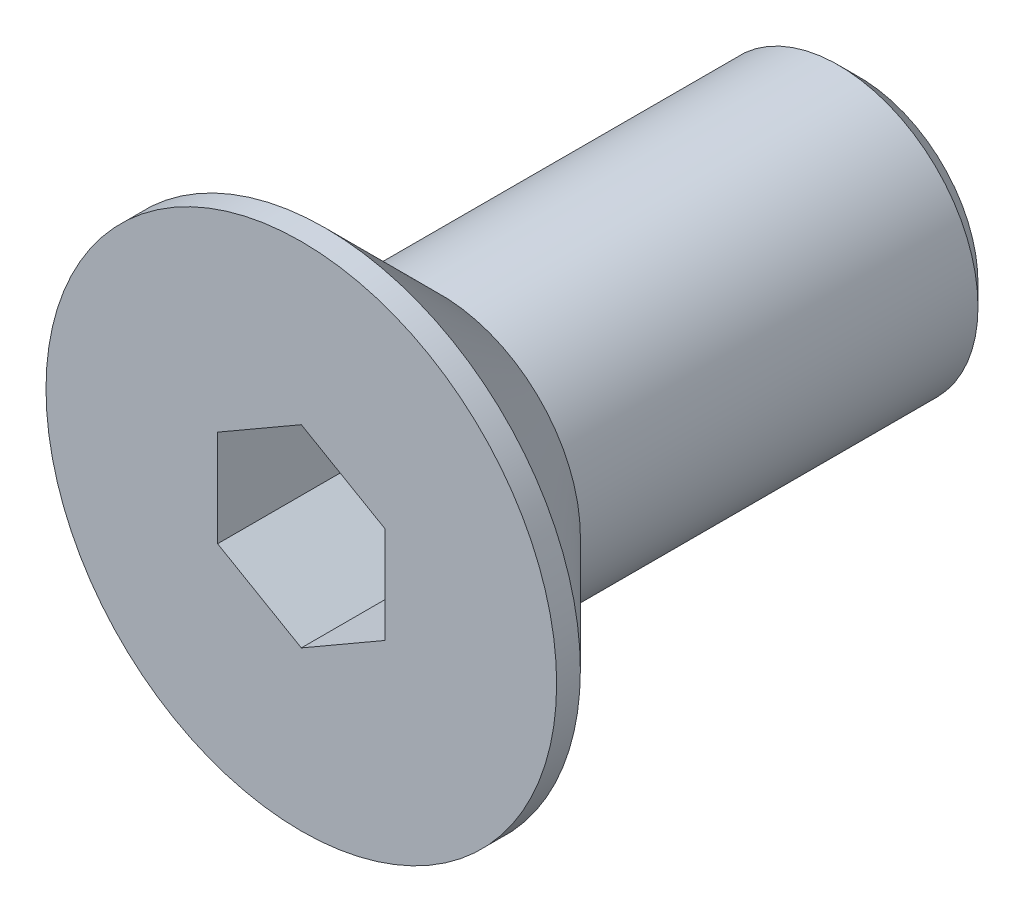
ISO-10303-21;
HEADER;
FILE_DESCRIPTION(('STEP AP214'),'2;1');
FILE_NAME('part.step','',(''),(''),'','','');
FILE_SCHEMA(('AUTOMOTIVE_DESIGN { 1 0 10303 214 1 1 1 1 }'));
ENDSEC;
DATA;
#1=APPLICATION_CONTEXT('core data for automotive mechanical design processes');
#2=APPLICATION_PROTOCOL_DEFINITION('international standard','automotive_design',2000,#1);
#3=PRODUCT_CONTEXT('',#1,'mechanical');
#4=PRODUCT('Part','Part','',(#3));
#5=PRODUCT_RELATED_PRODUCT_CATEGORY('part','',(#4));
#6=PRODUCT_DEFINITION_FORMATION('','',#4);
#7=PRODUCT_DEFINITION_CONTEXT('part definition',#1,'design');
#8=PRODUCT_DEFINITION('design','',#6,#7);
#9=PRODUCT_DEFINITION_SHAPE('','',#8);
#10=(LENGTH_UNIT() NAMED_UNIT(*) SI_UNIT(.MILLI.,.METRE.));
#11=(NAMED_UNIT(*) PLANE_ANGLE_UNIT() SI_UNIT($,.RADIAN.));
#12=(NAMED_UNIT(*) SI_UNIT($,.STERADIAN.) SOLID_ANGLE_UNIT());
#13=UNCERTAINTY_MEASURE_WITH_UNIT(LENGTH_MEASURE(1.E-05),#10,'distance_accuracy_value','');
#14=(GEOMETRIC_REPRESENTATION_CONTEXT(3) GLOBAL_UNCERTAINTY_ASSIGNED_CONTEXT((#13)) GLOBAL_UNIT_ASSIGNED_CONTEXT((#10,
#11,#12)) REPRESENTATION_CONTEXT('',''));
#15=CARTESIAN_POINT('',(0.,0.,0.));
#16=DIRECTION('',(0.,0.,1.));
#17=DIRECTION('',(1.,0.,0.));
#18=AXIS2_PLACEMENT_3D('',#15,#16,#17);
#19=CARTESIAN_POINT('',(0.,0.,-15.));
#20=DIRECTION('',(0.,0.,-1.));
#21=DIRECTION('',(-1.,0.,0.));
#22=AXIS2_PLACEMENT_3D('',#19,#20,#21);
#23=PLANE('',#22);
#24=CARTESIAN_POINT('',(0.,0.,-15.0000000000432));
#25=DIRECTION('',(0.,0.,1.));
#26=DIRECTION('',(0.,-1.,0.));
#27=AXIS2_PLACEMENT_3D('',#24,#25,#26);
#28=CIRCLE('',#27,4.24999999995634);
#29=CARTESIAN_POINT('',(0.,-4.24999999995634,-15.0000000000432));
#30=VERTEX_POINT('',#29);
#31=EDGE_CURVE('E20',#30,#30,#28,.T.);
#32=ORIENTED_EDGE('',*,*,#31,.F.);
#33=EDGE_LOOP('',(#32));
#34=FACE_BOUND('',#33,.T.);
#35=ADVANCED_FACE('F17',(#34),#23,.T.);
#36=CARTESIAN_POINT('',(0.,0.,-14.2500000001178));
#37=DIRECTION('',(0.,0.,1.));
#38=DIRECTION('',(0.,-1.,0.));
#39=AXIS2_PLACEMENT_3D('',#36,#37,#38);
#40=CONICAL_SURFACE('',#39,4.99999999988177,0.785398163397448);
#41=CARTESIAN_POINT('',(0.,0.,-14.25));
#42=DIRECTION('',(0.,0.,1.));
#43=DIRECTION('',(1.,0.,0.));
#44=AXIS2_PLACEMENT_3D('',#41,#42,#43);
#45=CIRCLE('',#44,5.);
#46=CARTESIAN_POINT('',(5.,0.,-14.25));
#47=VERTEX_POINT('',#46);
#48=EDGE_CURVE('E102',#47,#47,#45,.T.);
#49=ORIENTED_EDGE('',*,*,#48,.F.);
#50=EDGE_LOOP('',(#49));
#51=FACE_BOUND('',#50,.T.);
#52=ORIENTED_EDGE('',*,*,#31,.T.);
#53=EDGE_LOOP('',(#52));
#54=FACE_BOUND('',#53,.T.);
#55=ADVANCED_FACE('F109',(#51,#54),#40,.T.);
#56=CARTESIAN_POINT('',(0.,0.,0.));
#57=DIRECTION('',(0.,0.,1.));
#58=DIRECTION('',(1.,0.,0.));
#59=AXIS2_PLACEMENT_3D('',#56,#57,#58);
#60=CYLINDRICAL_SURFACE('',#59,5.);
#61=CARTESIAN_POINT('',(0.,0.,-2.61483543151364E-11));
#62=DIRECTION('',(0.,0.,1.));
#63=DIRECTION('',(1.,0.,0.));
#64=AXIS2_PLACEMENT_3D('',#61,#62,#63);
#65=CIRCLE('',#64,5.00000000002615);
#66=CARTESIAN_POINT('',(5.00000000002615,0.,-2.61483543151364E-11));
#67=VERTEX_POINT('',#66);
#68=EDGE_CURVE('E80',#67,#67,#65,.T.);
#69=ORIENTED_EDGE('',*,*,#68,.F.);
#70=EDGE_LOOP('',(#69));
#71=FACE_BOUND('',#70,.T.);
#72=ORIENTED_EDGE('',*,*,#48,.T.);
#73=EDGE_LOOP('',(#72));
#74=FACE_BOUND('',#73,.T.);
#75=ADVANCED_FACE('F116',(#71,#74),#60,.T.);
#76=CARTESIAN_POINT('',(3.,1.73205080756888,0.5));
#77=DIRECTION('',(0.,0.,1.));
#78=DIRECTION('',(1.,0.,0.));
#79=AXIS2_PLACEMENT_3D('',#76,#77,#78);
#80=PLANE('',#79);
#81=DIRECTION('',(0.866025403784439,0.5,0.));
#82=VECTOR('',#81,1.);
#83=CARTESIAN_POINT('',(0.,3.46410161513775,0.499999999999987));
#84=LINE('',#83,#82);
#85=CARTESIAN_POINT('',(-3.,1.73205080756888,0.499999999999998));
#86=VERTEX_POINT('',#85);
#87=CARTESIAN_POINT('',(0.,3.46410161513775,0.499999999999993));
#88=VERTEX_POINT('',#87);
#89=EDGE_CURVE('E66',#86,#88,#84,.T.);
#90=ORIENTED_EDGE('',*,*,#89,.F.);
#91=DIRECTION('',(0.,1.,0.));
#92=VECTOR('',#91,1.);
#93=CARTESIAN_POINT('',(-3.,1.73205080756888,0.5));
#94=LINE('',#93,#92);
#95=CARTESIAN_POINT('',(-3.,-1.73205080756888,0.499999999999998));
#96=VERTEX_POINT('',#95);
#97=EDGE_CURVE('E71',#96,#86,#94,.T.);
#98=ORIENTED_EDGE('',*,*,#97,.F.);
#99=DIRECTION('',(-0.866025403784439,0.5,0.));
#100=VECTOR('',#99,1.);
#101=CARTESIAN_POINT('',(-3.,-1.73205080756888,0.499999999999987));
#102=LINE('',#101,#100);
#103=CARTESIAN_POINT('',(0.,-3.46410161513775,0.499999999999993));
#104=VERTEX_POINT('',#103);
#105=EDGE_CURVE('E99',#104,#96,#102,.T.);
#106=ORIENTED_EDGE('',*,*,#105,.F.);
#107=DIRECTION('',(-0.866025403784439,-0.5,0.));
#108=VECTOR('',#107,1.);
#109=CARTESIAN_POINT('',(0.,-3.46410161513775,0.499999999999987));
#110=LINE('',#109,#108);
#111=CARTESIAN_POINT('',(3.,-1.73205080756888,0.499999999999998));
#112=VERTEX_POINT('',#111);
#113=EDGE_CURVE('E227',#112,#104,#110,.T.);
#114=ORIENTED_EDGE('',*,*,#113,.F.);
#115=DIRECTION('',(0.,-1.,0.));
#116=VECTOR('',#115,1.);
#117=CARTESIAN_POINT('',(3.,-1.73205080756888,0.5));
#118=LINE('',#117,#116);
#119=CARTESIAN_POINT('',(3.,1.73205080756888,0.499999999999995));
#120=VERTEX_POINT('',#119);
#121=EDGE_CURVE('E222',#120,#112,#118,.T.);
#122=ORIENTED_EDGE('',*,*,#121,.F.);
#123=DIRECTION('',(0.866025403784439,-0.5,0.));
#124=VECTOR('',#123,1.);
#125=CARTESIAN_POINT('',(3.,1.73205080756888,0.499999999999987));
#126=LINE('',#125,#124);
#127=EDGE_CURVE('E84',#88,#120,#126,.T.);
#128=ORIENTED_EDGE('',*,*,#127,.F.);
#129=EDGE_LOOP('',(#90,#98,#106,#114,#122,#128));
#130=FACE_BOUND('',#129,.T.);
#131=ADVANCED_FACE('F82',(#130),#80,.T.);
#132=CARTESIAN_POINT('',(0.,0.,4.14999999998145));
#133=DIRECTION('',(0.,0.,1.));
#134=DIRECTION('',(1.,0.,0.));
#135=AXIS2_PLACEMENT_3D('',#132,#133,#134);
#136=CONICAL_SURFACE('',#135,9.1499999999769,0.7853981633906);
#137=CARTESIAN_POINT('',(0.,0.,4.14999999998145));
#138=DIRECTION('',(0.,0.,1.));
#139=DIRECTION('',(1.,0.,0.));
#140=AXIS2_PLACEMENT_3D('',#137,#138,#139);
#141=CIRCLE('',#140,9.15);
#142=CARTESIAN_POINT('',(9.15,0.,4.14999999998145));
#143=VERTEX_POINT('',#142);
#144=EDGE_CURVE('E95',#143,#143,#141,.T.);
#145=ORIENTED_EDGE('',*,*,#144,.F.);
#146=EDGE_LOOP('',(#145));
#147=FACE_BOUND('',#146,.T.);
#148=ORIENTED_EDGE('',*,*,#68,.T.);
#149=EDGE_LOOP('',(#148));
#150=FACE_BOUND('',#149,.T.);
#151=ADVANCED_FACE('F149',(#147,#150),#136,.T.);
#152=CARTESIAN_POINT('',(-3.,1.73205080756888,33.2074914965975));
#153=DIRECTION('',(1.,0.,0.));
#154=DIRECTION('',(0.,1.,0.));
#155=AXIS2_PLACEMENT_3D('',#152,#153,#154);
#156=PLANE('',#155);
#157=DIRECTION('',(0.,0.,1.));
#158=VECTOR('',#157,1.);
#159=CARTESIAN_POINT('',(-3.,-1.73205080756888,33.2074914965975));
#160=LINE('',#159,#158);
#161=CARTESIAN_POINT('',(-3.,-1.73205080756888,5.));
#162=VERTEX_POINT('',#161);
#163=EDGE_CURVE('E76',#96,#162,#160,.T.);
#164=ORIENTED_EDGE('',*,*,#163,.F.);
#165=ORIENTED_EDGE('',*,*,#97,.T.);
#166=DIRECTION('',(0.,0.,1.));
#167=VECTOR('',#166,1.);
#168=CARTESIAN_POINT('',(-3.,1.73205080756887,33.2074914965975));
#169=LINE('',#168,#167);
#170=CARTESIAN_POINT('',(-3.,1.73205080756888,5.));
#171=VERTEX_POINT('',#170);
#172=EDGE_CURVE('E73',#171,#86,#169,.F.);
#173=ORIENTED_EDGE('',*,*,#172,.F.);
#174=DIRECTION('',(0.,1.,0.));
#175=VECTOR('',#174,1.);
#176=CARTESIAN_POINT('',(-3.,0.,5.));
#177=LINE('',#176,#175);
#178=EDGE_CURVE('E98',#162,#171,#177,.T.);
#179=ORIENTED_EDGE('',*,*,#178,.F.);
#180=EDGE_LOOP('',(#164,#165,#173,#179));
#181=FACE_BOUND('',#180,.T.);
#182=ADVANCED_FACE('F72',(#181),#156,.T.);
#183=CARTESIAN_POINT('',(0.,3.46410161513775,33.2074914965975));
#184=DIRECTION('',(0.5,-0.866025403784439,0.));
#185=DIRECTION('',(0.866025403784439,0.5,0.));
#186=AXIS2_PLACEMENT_3D('',#183,#184,#185);
#187=PLANE('',#186);
#188=ORIENTED_EDGE('',*,*,#172,.T.);
#189=ORIENTED_EDGE('',*,*,#89,.T.);
#190=DIRECTION('',(0.,0.,1.));
#191=VECTOR('',#190,1.);
#192=CARTESIAN_POINT('',(0.,3.46410161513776,33.2074914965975));
#193=LINE('',#192,#191);
#194=CARTESIAN_POINT('',(0.,3.46410161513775,4.99999999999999));
#195=VERTEX_POINT('',#194);
#196=EDGE_CURVE('E86',#195,#88,#193,.F.);
#197=ORIENTED_EDGE('',*,*,#196,.F.);
#198=DIRECTION('',(0.866025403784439,0.499999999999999,0.));
#199=VECTOR('',#198,1.);
#200=CARTESIAN_POINT('',(-3.,1.73205080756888,5.));
#201=LINE('',#200,#199);
#202=EDGE_CURVE('E90',#171,#195,#201,.T.);
#203=ORIENTED_EDGE('',*,*,#202,.F.);
#204=EDGE_LOOP('',(#188,#189,#197,#203));
#205=FACE_BOUND('',#204,.T.);
#206=ADVANCED_FACE('F88',(#205),#187,.T.);
#207=CARTESIAN_POINT('',(3.,1.73205080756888,33.2074914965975));
#208=DIRECTION('',(-0.5,-0.866025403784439,0.));
#209=DIRECTION('',(0.866025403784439,-0.5,0.));
#210=AXIS2_PLACEMENT_3D('',#207,#208,#209);
#211=PLANE('',#210);
#212=ORIENTED_EDGE('',*,*,#196,.T.);
#213=ORIENTED_EDGE('',*,*,#127,.T.);
#214=DIRECTION('',(0.,0.,1.));
#215=VECTOR('',#214,1.);
#216=CARTESIAN_POINT('',(3.,1.73205080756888,33.2074914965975));
#217=LINE('',#216,#215);
#218=CARTESIAN_POINT('',(3.,1.73205080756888,4.99999999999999));
#219=VERTEX_POINT('',#218);
#220=EDGE_CURVE('E217',#219,#120,#217,.F.);
#221=ORIENTED_EDGE('',*,*,#220,.F.);
#222=DIRECTION('',(0.866025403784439,-0.499999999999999,0.));
#223=VECTOR('',#222,1.);
#224=CARTESIAN_POINT('',(0.,3.46410161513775,5.));
#225=LINE('',#224,#223);
#226=EDGE_CURVE('E216',#195,#219,#225,.T.);
#227=ORIENTED_EDGE('',*,*,#226,.F.);
#228=EDGE_LOOP('',(#212,#213,#221,#227));
#229=FACE_BOUND('',#228,.T.);
#230=ADVANCED_FACE('F140',(#229),#211,.T.);
#231=CARTESIAN_POINT('',(3.,-1.73205080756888,33.2074914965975));
#232=DIRECTION('',(-1.,0.,0.));
#233=DIRECTION('',(0.,-1.,0.));
#234=AXIS2_PLACEMENT_3D('',#231,#232,#233);
#235=PLANE('',#234);
#236=ORIENTED_EDGE('',*,*,#220,.T.);
#237=ORIENTED_EDGE('',*,*,#121,.T.);
#238=DIRECTION('',(0.,0.,1.));
#239=VECTOR('',#238,1.);
#240=CARTESIAN_POINT('',(3.,-1.73205080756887,33.2074914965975));
#241=LINE('',#240,#239);
#242=CARTESIAN_POINT('',(3.,-1.73205080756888,5.));
#243=VERTEX_POINT('',#242);
#244=EDGE_CURVE('E224',#243,#112,#241,.F.);
#245=ORIENTED_EDGE('',*,*,#244,.F.);
#246=DIRECTION('',(0.,1.,0.));
#247=VECTOR('',#246,1.);
#248=CARTESIAN_POINT('',(3.,0.,5.));
#249=LINE('',#248,#247);
#250=EDGE_CURVE('E235',#219,#243,#249,.F.);
#251=ORIENTED_EDGE('',*,*,#250,.F.);
#252=EDGE_LOOP('',(#236,#237,#245,#251));
#253=FACE_BOUND('',#252,.T.);
#254=ADVANCED_FACE('F137',(#253),#235,.T.);
#255=CARTESIAN_POINT('',(0.,-3.46410161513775,33.2074914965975));
#256=DIRECTION('',(-0.5,0.866025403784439,0.));
#257=DIRECTION('',(-0.866025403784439,-0.5,0.));
#258=AXIS2_PLACEMENT_3D('',#255,#256,#257);
#259=PLANE('',#258);
#260=ORIENTED_EDGE('',*,*,#244,.T.);
#261=ORIENTED_EDGE('',*,*,#113,.T.);
#262=DIRECTION('',(0.,0.,1.));
#263=VECTOR('',#262,1.);
#264=CARTESIAN_POINT('',(0.,-3.46410161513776,33.2074914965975));
#265=LINE('',#264,#263);
#266=CARTESIAN_POINT('',(0.,-3.46410161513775,4.99999999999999));
#267=VERTEX_POINT('',#266);
#268=EDGE_CURVE('E34',#267,#104,#265,.F.);
#269=ORIENTED_EDGE('',*,*,#268,.F.);
#270=DIRECTION('',(-0.866025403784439,-0.499999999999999,0.));
#271=VECTOR('',#270,1.);
#272=CARTESIAN_POINT('',(3.,-1.73205080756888,5.));
#273=LINE('',#272,#271);
#274=EDGE_CURVE('E238',#243,#267,#273,.T.);
#275=ORIENTED_EDGE('',*,*,#274,.F.);
#276=EDGE_LOOP('',(#260,#261,#269,#275));
#277=FACE_BOUND('',#276,.T.);
#278=ADVANCED_FACE('F133',(#277),#259,.T.);
#279=CARTESIAN_POINT('',(-3.,-1.73205080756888,33.2074914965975));
#280=DIRECTION('',(0.5,0.866025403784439,0.));
#281=DIRECTION('',(-0.866025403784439,0.5,0.));
#282=AXIS2_PLACEMENT_3D('',#279,#280,#281);
#283=PLANE('',#282);
#284=ORIENTED_EDGE('',*,*,#268,.T.);
#285=ORIENTED_EDGE('',*,*,#105,.T.);
#286=ORIENTED_EDGE('',*,*,#163,.T.);
#287=DIRECTION('',(-0.866025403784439,0.499999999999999,0.));
#288=VECTOR('',#287,1.);
#289=CARTESIAN_POINT('',(0.,-3.46410161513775,5.));
#290=LINE('',#289,#288);
#291=EDGE_CURVE('E26',#267,#162,#290,.T.);
#292=ORIENTED_EDGE('',*,*,#291,.F.);
#293=EDGE_LOOP('',(#284,#285,#286,#292));
#294=FACE_BOUND('',#293,.T.);
#295=ADVANCED_FACE('F126',(#294),#283,.T.);
#296=CARTESIAN_POINT('',(0.,0.,0.));
#297=DIRECTION('',(0.,0.,1.));
#298=DIRECTION('',(1.,0.,0.));
#299=AXIS2_PLACEMENT_3D('',#296,#297,#298);
#300=CYLINDRICAL_SURFACE('',#299,9.15);
#301=CARTESIAN_POINT('',(0.,0.,5.));
#302=DIRECTION('',(0.,0.,1.));
#303=DIRECTION('',(1.,0.,0.));
#304=AXIS2_PLACEMENT_3D('',#301,#302,#303);
#305=CIRCLE('',#304,9.15);
#306=CARTESIAN_POINT('',(9.15,0.,5.));
#307=VERTEX_POINT('',#306);
#308=EDGE_CURVE('E11',#307,#307,#305,.T.);
#309=ORIENTED_EDGE('',*,*,#308,.F.);
#310=EDGE_LOOP('',(#309));
#311=FACE_BOUND('',#310,.T.);
#312=ORIENTED_EDGE('',*,*,#144,.T.);
#313=EDGE_LOOP('',(#312));
#314=FACE_BOUND('',#313,.T.);
#315=ADVANCED_FACE('F120',(#311,#314),#300,.T.);
#316=CARTESIAN_POINT('',(9.15,0.,5.));
#317=DIRECTION('',(0.,0.,1.));
#318=DIRECTION('',(1.,0.,0.));
#319=AXIS2_PLACEMENT_3D('',#316,#317,#318);
#320=PLANE('',#319);
#321=ORIENTED_EDGE('',*,*,#308,.T.);
#322=EDGE_LOOP('',(#321));
#323=FACE_BOUND('',#322,.T.);
#324=ORIENTED_EDGE('',*,*,#274,.T.);
#325=ORIENTED_EDGE('',*,*,#291,.T.);
#326=ORIENTED_EDGE('',*,*,#178,.T.);
#327=ORIENTED_EDGE('',*,*,#202,.T.);
#328=ORIENTED_EDGE('',*,*,#226,.T.);
#329=ORIENTED_EDGE('',*,*,#250,.T.);
#330=EDGE_LOOP('',(#324,#325,#326,#327,#328,#329));
#331=FACE_BOUND('',#330,.T.);
#332=ADVANCED_FACE('F118',(#323,#331),#320,.T.);
#333=CLOSED_SHELL('',(#35,#55,#75,#131,#151,#182,#206,#230,#254,#278,#295,#315,#332));
#334=MANIFOLD_SOLID_BREP('B1',#333);
#335=ADVANCED_BREP_SHAPE_REPRESENTATION('',(#18,#334),#14);
#336=SHAPE_DEFINITION_REPRESENTATION(#9,#335);
ENDSEC;
END-ISO-10303-21;
